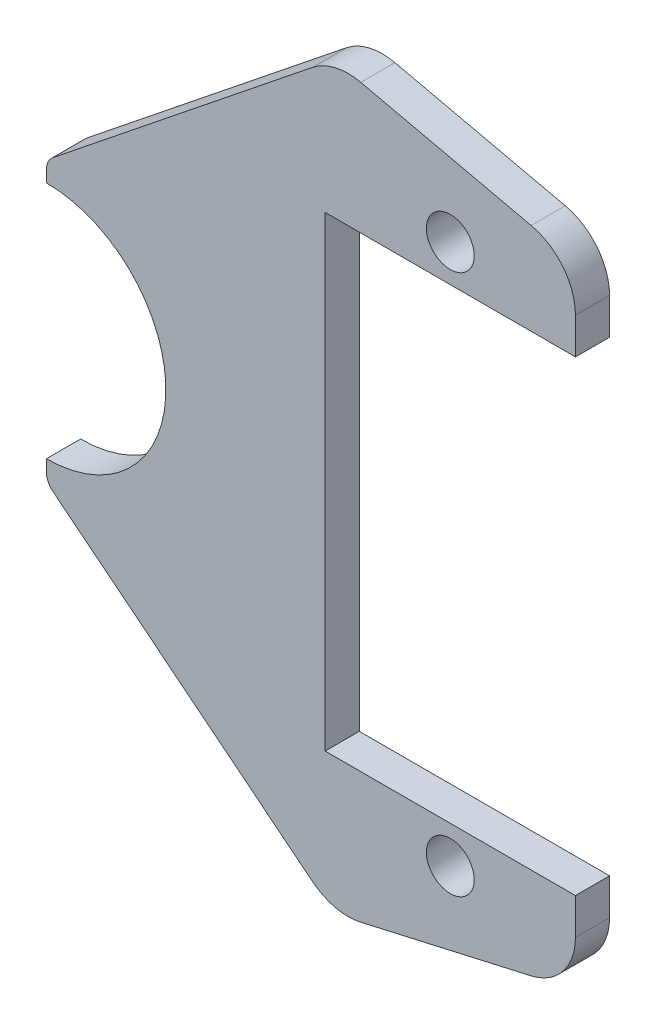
ISO-10303-21;
HEADER;
FILE_DESCRIPTION(('STEP AP214'),'2;1');
FILE_NAME('part.step','',(''),(''),'','','');
FILE_SCHEMA(('AUTOMOTIVE_DESIGN { 1 0 10303 214 1 1 1 1 }'));
ENDSEC;
DATA;
#1=APPLICATION_CONTEXT('core data for automotive mechanical design processes');
#2=APPLICATION_PROTOCOL_DEFINITION('international standard','automotive_design',2000,#1);
#3=PRODUCT_CONTEXT('',#1,'mechanical');
#4=PRODUCT('Part','Part','',(#3));
#5=PRODUCT_RELATED_PRODUCT_CATEGORY('part','',(#4));
#6=PRODUCT_DEFINITION_FORMATION('','',#4);
#7=PRODUCT_DEFINITION_CONTEXT('part definition',#1,'design');
#8=PRODUCT_DEFINITION('design','',#6,#7);
#9=PRODUCT_DEFINITION_SHAPE('','',#8);
#10=(LENGTH_UNIT() NAMED_UNIT(*) SI_UNIT(.MILLI.,.METRE.));
#11=(NAMED_UNIT(*) PLANE_ANGLE_UNIT() SI_UNIT($,.RADIAN.));
#12=(NAMED_UNIT(*) SI_UNIT($,.STERADIAN.) SOLID_ANGLE_UNIT());
#13=UNCERTAINTY_MEASURE_WITH_UNIT(LENGTH_MEASURE(1.E-05),#10,'distance_accuracy_value','');
#14=(GEOMETRIC_REPRESENTATION_CONTEXT(3) GLOBAL_UNCERTAINTY_ASSIGNED_CONTEXT((#13)) GLOBAL_UNIT_ASSIGNED_CONTEXT((#10,
#11,#12)) REPRESENTATION_CONTEXT('',''));
#15=CARTESIAN_POINT('',(0.,0.,0.));
#16=DIRECTION('',(0.,0.,1.));
#17=DIRECTION('',(1.,0.,0.));
#18=AXIS2_PLACEMENT_3D('',#15,#16,#17);
#19=CARTESIAN_POINT('',(83.,47.3732157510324,6.));
#20=DIRECTION('',(0.,0.,-1.));
#21=DIRECTION('',(-1.,0.,0.));
#22=AXIS2_PLACEMENT_3D('',#19,#20,#21);
#23=PLANE('',#22);
#24=CARTESIAN_POINT('',(71.,47.5,6.));
#25=DIRECTION('',(0.,0.,1.));
#26=DIRECTION('',(1.,0.,0.));
#27=AXIS2_PLACEMENT_3D('',#24,#25,#26);
#28=CIRCLE('',#27,4.2);
#29=CARTESIAN_POINT('',(75.2,47.5,6.));
#30=VERTEX_POINT('',#29);
#31=EDGE_CURVE('E174',#30,#30,#28,.T.);
#32=ORIENTED_EDGE('',*,*,#31,.F.);
#33=EDGE_LOOP('',(#32));
#34=FACE_BOUND('',#33,.T.);
#35=DIRECTION('',(1.,0.,0.));
#36=VECTOR('',#35,1.);
#37=CARTESIAN_POINT('',(49.,41.,6.));
#38=LINE('',#37,#36);
#39=CARTESIAN_POINT('',(49.,41.,6.));
#40=VERTEX_POINT('',#39);
#41=CARTESIAN_POINT('',(93.,41.,6.));
#42=VERTEX_POINT('',#41);
#43=EDGE_CURVE('E212',#40,#42,#38,.T.);
#44=ORIENTED_EDGE('',*,*,#43,.T.);
#45=DIRECTION('',(0.,1.,0.));
#46=VECTOR('',#45,1.);
#47=CARTESIAN_POINT('',(93.,41.,6.));
#48=LINE('',#47,#46);
#49=CARTESIAN_POINT('',(93.,47.3732157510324,6.));
#50=VERTEX_POINT('',#49);
#51=EDGE_CURVE('E169',#42,#50,#48,.T.);
#52=ORIENTED_EDGE('',*,*,#51,.T.);
#53=CARTESIAN_POINT('',(83.,47.3732157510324,6.));
#54=DIRECTION('',(0.,0.,1.));
#55=DIRECTION('',(-1.,0.,0.));
#56=AXIS2_PLACEMENT_3D('',#53,#54,#55);
#57=CIRCLE('',#56,10.);
#58=CARTESIAN_POINT('',(85.2154849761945,57.1247092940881,6.));
#59=VERTEX_POINT('',#58);
#60=EDGE_CURVE('E215',#50,#59,#57,.T.);
#61=ORIENTED_EDGE('',*,*,#60,.T.);
#62=DIRECTION('',(-0.975149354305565,0.221548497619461,0.));
#63=VECTOR('',#62,1.);
#64=CARTESIAN_POINT('',(85.2154849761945,57.1247092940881,6.));
#65=LINE('',#64,#63);
#66=CARTESIAN_POINT('',(55.2558255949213,63.9313769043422,6.));
#67=VERTEX_POINT('',#66);
#68=EDGE_CURVE('E217',#59,#67,#65,.T.);
#69=ORIENTED_EDGE('',*,*,#68,.T.);
#70=CARTESIAN_POINT('',(53.0403406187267,54.1798833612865,6.));
#71=DIRECTION('',(0.,0.,1.));
#72=DIRECTION('',(-1.,0.,0.));
#73=AXIS2_PLACEMENT_3D('',#70,#71,#72);
#74=CIRCLE('',#73,10.);
#75=CARTESIAN_POINT('',(46.7879140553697,61.9841874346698,6.));
#76=VERTEX_POINT('',#75);
#77=EDGE_CURVE('E219',#67,#76,#74,.T.);
#78=ORIENTED_EDGE('',*,*,#77,.T.);
#79=DIRECTION('',(-0.780430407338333,-0.625242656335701,0.));
#80=VECTOR('',#79,1.);
#81=CARTESIAN_POINT('',(46.7879140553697,61.9841874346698,6.));
#82=LINE('',#81,#80);
#83=CARTESIAN_POINT('',(1.12427203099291,25.4007117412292,6.));
#84=VERTEX_POINT('',#83);
#85=EDGE_CURVE('E221',#76,#84,#82,.T.);
#86=ORIENTED_EDGE('',*,*,#85,.T.);
#87=CARTESIAN_POINT('',(3.,23.0594205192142,6.));
#88=DIRECTION('',(0.,0.,1.));
#89=DIRECTION('',(1.,0.,0.));
#90=AXIS2_PLACEMENT_3D('',#87,#88,#89);
#91=CIRCLE('',#90,3.);
#92=CARTESIAN_POINT('',(0.,23.0594205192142,6.));
#93=VERTEX_POINT('',#92);
#94=EDGE_CURVE('E223',#84,#93,#91,.T.);
#95=ORIENTED_EDGE('',*,*,#94,.T.);
#96=DIRECTION('',(0.,-1.,0.));
#97=VECTOR('',#96,1.);
#98=CARTESIAN_POINT('',(0.,23.0594205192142,6.));
#99=LINE('',#98,#97);
#100=CARTESIAN_POINT('',(0.,21.,6.));
#101=VERTEX_POINT('',#100);
#102=EDGE_CURVE('E225',#93,#101,#99,.T.);
#103=ORIENTED_EDGE('',*,*,#102,.T.);
#104=CARTESIAN_POINT('',(0.,0.,6.));
#105=DIRECTION('',(0.,0.,-1.));
#106=DIRECTION('',(-1.,0.,0.));
#107=AXIS2_PLACEMENT_3D('',#104,#105,#106);
#108=CIRCLE('',#107,21.);
#109=CARTESIAN_POINT('',(0.,-21.,6.));
#110=VERTEX_POINT('',#109);
#111=EDGE_CURVE('E227',#101,#110,#108,.T.);
#112=ORIENTED_EDGE('',*,*,#111,.T.);
#113=DIRECTION('',(0.,-1.,0.));
#114=VECTOR('',#113,1.);
#115=CARTESIAN_POINT('',(0.,-23.0594205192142,6.));
#116=LINE('',#115,#114);
#117=CARTESIAN_POINT('',(0.,-23.0594205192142,6.));
#118=VERTEX_POINT('',#117);
#119=EDGE_CURVE('E229',#110,#118,#116,.T.);
#120=ORIENTED_EDGE('',*,*,#119,.T.);
#121=CARTESIAN_POINT('',(3.,-23.0594205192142,6.));
#122=DIRECTION('',(0.,0.,1.));
#123=DIRECTION('',(-1.,0.,0.));
#124=AXIS2_PLACEMENT_3D('',#121,#122,#123);
#125=CIRCLE('',#124,3.);
#126=CARTESIAN_POINT('',(1.12427203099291,-25.4007117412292,6.));
#127=VERTEX_POINT('',#126);
#128=EDGE_CURVE('E231',#118,#127,#125,.T.);
#129=ORIENTED_EDGE('',*,*,#128,.T.);
#130=DIRECTION('',(0.780430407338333,-0.625242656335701,0.));
#131=VECTOR('',#130,1.);
#132=CARTESIAN_POINT('',(46.7879140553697,-61.9841874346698,6.));
#133=LINE('',#132,#131);
#134=CARTESIAN_POINT('',(46.7879140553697,-61.9841874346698,6.));
#135=VERTEX_POINT('',#134);
#136=EDGE_CURVE('E233',#127,#135,#133,.T.);
#137=ORIENTED_EDGE('',*,*,#136,.T.);
#138=CARTESIAN_POINT('',(53.0403406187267,-54.1798833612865,6.));
#139=DIRECTION('',(0.,0.,1.));
#140=DIRECTION('',(1.,0.,0.));
#141=AXIS2_PLACEMENT_3D('',#138,#139,#140);
#142=CIRCLE('',#141,10.);
#143=CARTESIAN_POINT('',(55.2558255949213,-63.9313769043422,6.));
#144=VERTEX_POINT('',#143);
#145=EDGE_CURVE('E235',#135,#144,#142,.T.);
#146=ORIENTED_EDGE('',*,*,#145,.T.);
#147=DIRECTION('',(0.975149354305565,0.221548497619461,0.));
#148=VECTOR('',#147,1.);
#149=CARTESIAN_POINT('',(85.2154849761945,-57.1247092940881,6.));
#150=LINE('',#149,#148);
#151=CARTESIAN_POINT('',(85.2154849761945,-57.1247092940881,6.));
#152=VERTEX_POINT('',#151);
#153=EDGE_CURVE('E237',#144,#152,#150,.T.);
#154=ORIENTED_EDGE('',*,*,#153,.T.);
#155=CARTESIAN_POINT('',(83.,-47.3732157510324,6.));
#156=DIRECTION('',(0.,0.,1.));
#157=DIRECTION('',(1.,0.,0.));
#158=AXIS2_PLACEMENT_3D('',#155,#156,#157);
#159=CIRCLE('',#158,10.);
#160=CARTESIAN_POINT('',(93.,-47.3732157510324,6.));
#161=VERTEX_POINT('',#160);
#162=EDGE_CURVE('E239',#152,#161,#159,.T.);
#163=ORIENTED_EDGE('',*,*,#162,.T.);
#164=DIRECTION('',(0.,1.,0.));
#165=VECTOR('',#164,1.);
#166=CARTESIAN_POINT('',(93.,-41.,6.));
#167=LINE('',#166,#165);
#168=CARTESIAN_POINT('',(93.,-41.,6.));
#169=VERTEX_POINT('',#168);
#170=EDGE_CURVE('E241',#161,#169,#167,.T.);
#171=ORIENTED_EDGE('',*,*,#170,.T.);
#172=DIRECTION('',(-1.,0.,0.));
#173=VECTOR('',#172,1.);
#174=CARTESIAN_POINT('',(49.,-41.,6.));
#175=LINE('',#174,#173);
#176=CARTESIAN_POINT('',(49.,-41.,6.));
#177=VERTEX_POINT('',#176);
#178=EDGE_CURVE('E50',#169,#177,#175,.T.);
#179=ORIENTED_EDGE('',*,*,#178,.T.);
#180=DIRECTION('',(0.,1.,0.));
#181=VECTOR('',#180,1.);
#182=CARTESIAN_POINT('',(49.,-41.,6.));
#183=LINE('',#182,#181);
#184=EDGE_CURVE('E45',#177,#40,#183,.T.);
#185=ORIENTED_EDGE('',*,*,#184,.T.);
#186=EDGE_LOOP('',(#44,#52,#61,#69,#78,#86,#95,#103,#112,#120,#129,#137,#146,#154,#163,#171,
#179,#185));
#187=FACE_BOUND('',#186,.T.);
#188=CARTESIAN_POINT('',(71.,-47.5,6.));
#189=DIRECTION('',(0.,0.,1.));
#190=DIRECTION('',(-1.,0.,0.));
#191=AXIS2_PLACEMENT_3D('',#188,#189,#190);
#192=CIRCLE('',#191,4.2);
#193=CARTESIAN_POINT('',(66.8,-47.5,6.));
#194=VERTEX_POINT('',#193);
#195=EDGE_CURVE('E392',#194,#194,#192,.T.);
#196=ORIENTED_EDGE('',*,*,#195,.F.);
#197=EDGE_LOOP('',(#196));
#198=FACE_BOUND('',#197,.T.);
#199=ADVANCED_FACE('F30',(#34,#187,#198),#23,.F.);
#200=CARTESIAN_POINT('',(83.,47.3732157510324,0.));
#201=DIRECTION('',(0.,0.,-1.));
#202=DIRECTION('',(-1.,0.,0.));
#203=AXIS2_PLACEMENT_3D('',#200,#201,#202);
#204=PLANE('',#203);
#205=CARTESIAN_POINT('',(71.,47.5,0.));
#206=DIRECTION('',(0.,0.,1.));
#207=DIRECTION('',(1.,0.,0.));
#208=AXIS2_PLACEMENT_3D('',#205,#206,#207);
#209=CIRCLE('',#208,4.2);
#210=CARTESIAN_POINT('',(75.2,47.5,0.));
#211=VERTEX_POINT('',#210);
#212=EDGE_CURVE('E177',#211,#211,#209,.T.);
#213=ORIENTED_EDGE('',*,*,#212,.T.);
#214=EDGE_LOOP('',(#213));
#215=FACE_BOUND('',#214,.T.);
#216=DIRECTION('',(1.,0.,0.));
#217=VECTOR('',#216,1.);
#218=CARTESIAN_POINT('',(49.,41.,0.));
#219=LINE('',#218,#217);
#220=CARTESIAN_POINT('',(49.,41.,0.));
#221=VERTEX_POINT('',#220);
#222=CARTESIAN_POINT('',(93.,41.,0.));
#223=VERTEX_POINT('',#222);
#224=EDGE_CURVE('E160',#221,#223,#219,.T.);
#225=ORIENTED_EDGE('',*,*,#224,.F.);
#226=DIRECTION('',(0.,1.,0.));
#227=VECTOR('',#226,1.);
#228=CARTESIAN_POINT('',(49.,-41.,0.));
#229=LINE('',#228,#227);
#230=CARTESIAN_POINT('',(49.,-41.,0.));
#231=VERTEX_POINT('',#230);
#232=EDGE_CURVE('E210',#231,#221,#229,.T.);
#233=ORIENTED_EDGE('',*,*,#232,.F.);
#234=DIRECTION('',(-1.,0.,0.));
#235=VECTOR('',#234,1.);
#236=CARTESIAN_POINT('',(49.,-41.,0.));
#237=LINE('',#236,#235);
#238=CARTESIAN_POINT('',(93.,-41.,0.));
#239=VERTEX_POINT('',#238);
#240=EDGE_CURVE('E208',#239,#231,#237,.T.);
#241=ORIENTED_EDGE('',*,*,#240,.F.);
#242=DIRECTION('',(0.,1.,0.));
#243=VECTOR('',#242,1.);
#244=CARTESIAN_POINT('',(93.,-41.,0.));
#245=LINE('',#244,#243);
#246=CARTESIAN_POINT('',(93.,-47.3732157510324,0.));
#247=VERTEX_POINT('',#246);
#248=EDGE_CURVE('E206',#247,#239,#245,.T.);
#249=ORIENTED_EDGE('',*,*,#248,.F.);
#250=CARTESIAN_POINT('',(83.,-47.3732157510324,0.));
#251=DIRECTION('',(0.,0.,1.));
#252=DIRECTION('',(1.,0.,0.));
#253=AXIS2_PLACEMENT_3D('',#250,#251,#252);
#254=CIRCLE('',#253,10.);
#255=CARTESIAN_POINT('',(85.2154849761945,-57.1247092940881,0.));
#256=VERTEX_POINT('',#255);
#257=EDGE_CURVE('E204',#256,#247,#254,.T.);
#258=ORIENTED_EDGE('',*,*,#257,.F.);
#259=DIRECTION('',(0.975149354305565,0.221548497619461,0.));
#260=VECTOR('',#259,1.);
#261=CARTESIAN_POINT('',(85.2154849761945,-57.1247092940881,0.));
#262=LINE('',#261,#260);
#263=CARTESIAN_POINT('',(55.2558255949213,-63.9313769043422,0.));
#264=VERTEX_POINT('',#263);
#265=EDGE_CURVE('E202',#264,#256,#262,.T.);
#266=ORIENTED_EDGE('',*,*,#265,.F.);
#267=CARTESIAN_POINT('',(53.0403406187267,-54.1798833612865,0.));
#268=DIRECTION('',(0.,0.,1.));
#269=DIRECTION('',(1.,0.,0.));
#270=AXIS2_PLACEMENT_3D('',#267,#268,#269);
#271=CIRCLE('',#270,10.);
#272=CARTESIAN_POINT('',(46.7879140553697,-61.9841874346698,0.));
#273=VERTEX_POINT('',#272);
#274=EDGE_CURVE('E200',#273,#264,#271,.T.);
#275=ORIENTED_EDGE('',*,*,#274,.F.);
#276=DIRECTION('',(0.780430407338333,-0.625242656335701,0.));
#277=VECTOR('',#276,1.);
#278=CARTESIAN_POINT('',(46.7879140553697,-61.9841874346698,0.));
#279=LINE('',#278,#277);
#280=CARTESIAN_POINT('',(1.12427203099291,-25.4007117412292,0.));
#281=VERTEX_POINT('',#280);
#282=EDGE_CURVE('E198',#281,#273,#279,.T.);
#283=ORIENTED_EDGE('',*,*,#282,.F.);
#284=CARTESIAN_POINT('',(3.,-23.0594205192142,0.));
#285=DIRECTION('',(0.,0.,1.));
#286=DIRECTION('',(-1.,0.,0.));
#287=AXIS2_PLACEMENT_3D('',#284,#285,#286);
#288=CIRCLE('',#287,3.);
#289=CARTESIAN_POINT('',(0.,-23.0594205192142,0.));
#290=VERTEX_POINT('',#289);
#291=EDGE_CURVE('E196',#290,#281,#288,.T.);
#292=ORIENTED_EDGE('',*,*,#291,.F.);
#293=DIRECTION('',(0.,-1.,0.));
#294=VECTOR('',#293,1.);
#295=CARTESIAN_POINT('',(0.,-23.0594205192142,0.));
#296=LINE('',#295,#294);
#297=CARTESIAN_POINT('',(0.,-21.,0.));
#298=VERTEX_POINT('',#297);
#299=EDGE_CURVE('E194',#298,#290,#296,.T.);
#300=ORIENTED_EDGE('',*,*,#299,.F.);
#301=CARTESIAN_POINT('',(0.,0.,0.));
#302=DIRECTION('',(0.,0.,-1.));
#303=DIRECTION('',(-1.,0.,0.));
#304=AXIS2_PLACEMENT_3D('',#301,#302,#303);
#305=CIRCLE('',#304,21.);
#306=CARTESIAN_POINT('',(0.,21.,0.));
#307=VERTEX_POINT('',#306);
#308=EDGE_CURVE('E192',#307,#298,#305,.T.);
#309=ORIENTED_EDGE('',*,*,#308,.F.);
#310=DIRECTION('',(0.,-1.,0.));
#311=VECTOR('',#310,1.);
#312=CARTESIAN_POINT('',(0.,23.0594205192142,0.));
#313=LINE('',#312,#311);
#314=CARTESIAN_POINT('',(0.,23.0594205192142,0.));
#315=VERTEX_POINT('',#314);
#316=EDGE_CURVE('E190',#315,#307,#313,.T.);
#317=ORIENTED_EDGE('',*,*,#316,.F.);
#318=CARTESIAN_POINT('',(3.,23.0594205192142,0.));
#319=DIRECTION('',(0.,0.,1.));
#320=DIRECTION('',(1.,0.,0.));
#321=AXIS2_PLACEMENT_3D('',#318,#319,#320);
#322=CIRCLE('',#321,3.);
#323=CARTESIAN_POINT('',(1.12427203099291,25.4007117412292,0.));
#324=VERTEX_POINT('',#323);
#325=EDGE_CURVE('E188',#324,#315,#322,.T.);
#326=ORIENTED_EDGE('',*,*,#325,.F.);
#327=DIRECTION('',(-0.780430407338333,-0.625242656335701,0.));
#328=VECTOR('',#327,1.);
#329=CARTESIAN_POINT('',(46.7879140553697,61.9841874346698,0.));
#330=LINE('',#329,#328);
#331=CARTESIAN_POINT('',(46.7879140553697,61.9841874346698,0.));
#332=VERTEX_POINT('',#331);
#333=EDGE_CURVE('E186',#332,#324,#330,.T.);
#334=ORIENTED_EDGE('',*,*,#333,.F.);
#335=CARTESIAN_POINT('',(53.0403406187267,54.1798833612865,0.));
#336=DIRECTION('',(0.,0.,1.));
#337=DIRECTION('',(-1.,0.,0.));
#338=AXIS2_PLACEMENT_3D('',#335,#336,#337);
#339=CIRCLE('',#338,10.);
#340=CARTESIAN_POINT('',(55.2558255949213,63.9313769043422,0.));
#341=VERTEX_POINT('',#340);
#342=EDGE_CURVE('E184',#341,#332,#339,.T.);
#343=ORIENTED_EDGE('',*,*,#342,.F.);
#344=DIRECTION('',(-0.975149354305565,0.221548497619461,0.));
#345=VECTOR('',#344,1.);
#346=CARTESIAN_POINT('',(85.2154849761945,57.1247092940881,0.));
#347=LINE('',#346,#345);
#348=CARTESIAN_POINT('',(85.2154849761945,57.1247092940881,0.));
#349=VERTEX_POINT('',#348);
#350=EDGE_CURVE('E182',#349,#341,#347,.T.);
#351=ORIENTED_EDGE('',*,*,#350,.F.);
#352=CARTESIAN_POINT('',(83.,47.3732157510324,0.));
#353=DIRECTION('',(0.,0.,1.));
#354=DIRECTION('',(-1.,0.,0.));
#355=AXIS2_PLACEMENT_3D('',#352,#353,#354);
#356=CIRCLE('',#355,10.);
#357=CARTESIAN_POINT('',(93.,47.3732157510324,0.));
#358=VERTEX_POINT('',#357);
#359=EDGE_CURVE('E162',#358,#349,#356,.T.);
#360=ORIENTED_EDGE('',*,*,#359,.F.);
#361=DIRECTION('',(0.,1.,0.));
#362=VECTOR('',#361,1.);
#363=CARTESIAN_POINT('',(93.,41.,0.));
#364=LINE('',#363,#362);
#365=EDGE_CURVE('E155',#223,#358,#364,.T.);
#366=ORIENTED_EDGE('',*,*,#365,.F.);
#367=EDGE_LOOP('',(#225,#233,#241,#249,#258,#266,#275,#283,#292,#300,#309,#317,#326,#334,#343,
#351,#360,#366));
#368=FACE_BOUND('',#367,.T.);
#369=CARTESIAN_POINT('',(71.,-47.5,0.));
#370=DIRECTION('',(0.,0.,1.));
#371=DIRECTION('',(-1.,0.,0.));
#372=AXIS2_PLACEMENT_3D('',#369,#370,#371);
#373=CIRCLE('',#372,4.2);
#374=CARTESIAN_POINT('',(66.8,-47.5,0.));
#375=VERTEX_POINT('',#374);
#376=EDGE_CURVE('E395',#375,#375,#373,.T.);
#377=ORIENTED_EDGE('',*,*,#376,.T.);
#378=EDGE_LOOP('',(#377));
#379=FACE_BOUND('',#378,.T.);
#380=ADVANCED_FACE('F156',(#215,#368,#379),#204,.T.);
#381=CARTESIAN_POINT('',(49.,41.,6.));
#382=DIRECTION('',(0.,1.,0.));
#383=DIRECTION('',(-1.,0.,0.));
#384=AXIS2_PLACEMENT_3D('',#381,#382,#383);
#385=PLANE('',#384);
#386=ORIENTED_EDGE('',*,*,#224,.T.);
#387=DIRECTION('',(0.,0.,-1.));
#388=VECTOR('',#387,1.);
#389=CARTESIAN_POINT('',(93.,41.,6.));
#390=LINE('',#389,#388);
#391=EDGE_CURVE('E11',#42,#223,#390,.T.);
#392=ORIENTED_EDGE('',*,*,#391,.F.);
#393=ORIENTED_EDGE('',*,*,#43,.F.);
#394=DIRECTION('',(0.,0.,-1.));
#395=VECTOR('',#394,1.);
#396=CARTESIAN_POINT('',(49.,41.,6.));
#397=LINE('',#396,#395);
#398=EDGE_CURVE('E173',#40,#221,#397,.T.);
#399=ORIENTED_EDGE('',*,*,#398,.T.);
#400=EDGE_LOOP('',(#386,#392,#393,#399));
#401=FACE_BOUND('',#400,.T.);
#402=ADVANCED_FACE('F32',(#401),#385,.F.);
#403=CARTESIAN_POINT('',(93.,41.,6.));
#404=DIRECTION('',(-1.,0.,0.));
#405=DIRECTION('',(0.,0.,1.));
#406=AXIS2_PLACEMENT_3D('',#403,#404,#405);
#407=PLANE('',#406);
#408=ORIENTED_EDGE('',*,*,#365,.T.);
#409=DIRECTION('',(0.,0.,-1.));
#410=VECTOR('',#409,1.);
#411=CARTESIAN_POINT('',(93.,47.3732157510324,6.));
#412=LINE('',#411,#410);
#413=EDGE_CURVE('E38',#50,#358,#412,.T.);
#414=ORIENTED_EDGE('',*,*,#413,.F.);
#415=ORIENTED_EDGE('',*,*,#51,.F.);
#416=ORIENTED_EDGE('',*,*,#391,.T.);
#417=EDGE_LOOP('',(#408,#414,#415,#416));
#418=FACE_BOUND('',#417,.T.);
#419=ADVANCED_FACE('F168',(#418),#407,.F.);
#420=CARTESIAN_POINT('',(83.,47.3732157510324,6.));
#421=DIRECTION('',(0.,0.,-1.));
#422=DIRECTION('',(-1.,0.,0.));
#423=AXIS2_PLACEMENT_3D('',#420,#421,#422);
#424=CYLINDRICAL_SURFACE('',#423,10.);
#425=ORIENTED_EDGE('',*,*,#359,.T.);
#426=DIRECTION('',(0.,0.,-1.));
#427=VECTOR('',#426,1.);
#428=CARTESIAN_POINT('',(85.2154849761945,57.1247092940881,6.));
#429=LINE('',#428,#427);
#430=EDGE_CURVE('E288',#59,#349,#429,.T.);
#431=ORIENTED_EDGE('',*,*,#430,.F.);
#432=ORIENTED_EDGE('',*,*,#60,.F.);
#433=ORIENTED_EDGE('',*,*,#413,.T.);
#434=EDGE_LOOP('',(#425,#431,#432,#433));
#435=FACE_BOUND('',#434,.T.);
#436=ADVANCED_FACE('F292',(#435),#424,.T.);
#437=CARTESIAN_POINT('',(85.2154849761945,57.1247092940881,6.));
#438=DIRECTION('',(-0.221548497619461,-0.975149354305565,0.));
#439=DIRECTION('',(0.975149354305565,-0.221548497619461,0.));
#440=AXIS2_PLACEMENT_3D('',#437,#438,#439);
#441=PLANE('',#440);
#442=ORIENTED_EDGE('',*,*,#350,.T.);
#443=DIRECTION('',(0.,0.,-1.));
#444=VECTOR('',#443,1.);
#445=CARTESIAN_POINT('',(55.2558255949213,63.9313769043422,6.));
#446=LINE('',#445,#444);
#447=EDGE_CURVE('E285',#67,#341,#446,.T.);
#448=ORIENTED_EDGE('',*,*,#447,.F.);
#449=ORIENTED_EDGE('',*,*,#68,.F.);
#450=ORIENTED_EDGE('',*,*,#430,.T.);
#451=EDGE_LOOP('',(#442,#448,#449,#450));
#452=FACE_BOUND('',#451,.T.);
#453=ADVANCED_FACE('F300',(#452),#441,.F.);
#454=CARTESIAN_POINT('',(53.0403406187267,54.1798833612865,6.));
#455=DIRECTION('',(0.,0.,-1.));
#456=DIRECTION('',(-1.,0.,0.));
#457=AXIS2_PLACEMENT_3D('',#454,#455,#456);
#458=CYLINDRICAL_SURFACE('',#457,10.);
#459=ORIENTED_EDGE('',*,*,#342,.T.);
#460=DIRECTION('',(0.,0.,-1.));
#461=VECTOR('',#460,1.);
#462=CARTESIAN_POINT('',(46.7879140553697,61.9841874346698,6.));
#463=LINE('',#462,#461);
#464=EDGE_CURVE('E282',#76,#332,#463,.T.);
#465=ORIENTED_EDGE('',*,*,#464,.F.);
#466=ORIENTED_EDGE('',*,*,#77,.F.);
#467=ORIENTED_EDGE('',*,*,#447,.T.);
#468=EDGE_LOOP('',(#459,#465,#466,#467));
#469=FACE_BOUND('',#468,.T.);
#470=ADVANCED_FACE('F303',(#469),#458,.T.);
#471=CARTESIAN_POINT('',(46.7879140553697,61.9841874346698,6.));
#472=DIRECTION('',(0.625242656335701,-0.780430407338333,0.));
#473=DIRECTION('',(0.780430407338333,0.625242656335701,0.));
#474=AXIS2_PLACEMENT_3D('',#471,#472,#473);
#475=PLANE('',#474);
#476=ORIENTED_EDGE('',*,*,#333,.T.);
#477=DIRECTION('',(0.,0.,-1.));
#478=VECTOR('',#477,1.);
#479=CARTESIAN_POINT('',(1.12427203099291,25.4007117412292,6.));
#480=LINE('',#479,#478);
#481=EDGE_CURVE('E279',#84,#324,#480,.T.);
#482=ORIENTED_EDGE('',*,*,#481,.F.);
#483=ORIENTED_EDGE('',*,*,#85,.F.);
#484=ORIENTED_EDGE('',*,*,#464,.T.);
#485=EDGE_LOOP('',(#476,#482,#483,#484));
#486=FACE_BOUND('',#485,.T.);
#487=ADVANCED_FACE('F308',(#486),#475,.F.);
#488=CARTESIAN_POINT('',(3.,23.0594205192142,6.));
#489=DIRECTION('',(0.,0.,-1.));
#490=DIRECTION('',(-1.,0.,0.));
#491=AXIS2_PLACEMENT_3D('',#488,#489,#490);
#492=CYLINDRICAL_SURFACE('',#491,3.);
#493=ORIENTED_EDGE('',*,*,#325,.T.);
#494=DIRECTION('',(0.,0.,-1.));
#495=VECTOR('',#494,1.);
#496=CARTESIAN_POINT('',(0.,23.0594205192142,6.));
#497=LINE('',#496,#495);
#498=EDGE_CURVE('E276',#93,#315,#497,.T.);
#499=ORIENTED_EDGE('',*,*,#498,.F.);
#500=ORIENTED_EDGE('',*,*,#94,.F.);
#501=ORIENTED_EDGE('',*,*,#481,.T.);
#502=EDGE_LOOP('',(#493,#499,#500,#501));
#503=FACE_BOUND('',#502,.T.);
#504=ADVANCED_FACE('F314',(#503),#492,.T.);
#505=CARTESIAN_POINT('',(0.,23.0594205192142,6.));
#506=DIRECTION('',(1.,0.,0.));
#507=DIRECTION('',(0.,1.,0.));
#508=AXIS2_PLACEMENT_3D('',#505,#506,#507);
#509=PLANE('',#508);
#510=ORIENTED_EDGE('',*,*,#316,.T.);
#511=DIRECTION('',(0.,0.,-1.));
#512=VECTOR('',#511,1.);
#513=CARTESIAN_POINT('',(0.,21.,6.));
#514=LINE('',#513,#512);
#515=EDGE_CURVE('E273',#101,#307,#514,.T.);
#516=ORIENTED_EDGE('',*,*,#515,.F.);
#517=ORIENTED_EDGE('',*,*,#102,.F.);
#518=ORIENTED_EDGE('',*,*,#498,.T.);
#519=EDGE_LOOP('',(#510,#516,#517,#518));
#520=FACE_BOUND('',#519,.T.);
#521=ADVANCED_FACE('F318',(#520),#509,.F.);
#522=CARTESIAN_POINT('',(0.,0.,6.));
#523=DIRECTION('',(0.,0.,-1.));
#524=DIRECTION('',(-1.,0.,0.));
#525=AXIS2_PLACEMENT_3D('',#522,#523,#524);
#526=CYLINDRICAL_SURFACE('',#525,21.);
#527=ORIENTED_EDGE('',*,*,#308,.T.);
#528=DIRECTION('',(0.,0.,-1.));
#529=VECTOR('',#528,1.);
#530=CARTESIAN_POINT('',(0.,-21.,6.));
#531=LINE('',#530,#529);
#532=EDGE_CURVE('E270',#110,#298,#531,.T.);
#533=ORIENTED_EDGE('',*,*,#532,.F.);
#534=ORIENTED_EDGE('',*,*,#111,.F.);
#535=ORIENTED_EDGE('',*,*,#515,.T.);
#536=EDGE_LOOP('',(#527,#533,#534,#535));
#537=FACE_BOUND('',#536,.T.);
#538=ADVANCED_FACE('F323',(#537),#526,.F.);
#539=CARTESIAN_POINT('',(0.,-23.0594205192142,6.));
#540=DIRECTION('',(1.,0.,0.));
#541=DIRECTION('',(0.,1.,0.));
#542=AXIS2_PLACEMENT_3D('',#539,#540,#541);
#543=PLANE('',#542);
#544=ORIENTED_EDGE('',*,*,#299,.T.);
#545=DIRECTION('',(0.,0.,-1.));
#546=VECTOR('',#545,1.);
#547=CARTESIAN_POINT('',(0.,-23.0594205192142,6.));
#548=LINE('',#547,#546);
#549=EDGE_CURVE('E267',#118,#290,#548,.T.);
#550=ORIENTED_EDGE('',*,*,#549,.F.);
#551=ORIENTED_EDGE('',*,*,#119,.F.);
#552=ORIENTED_EDGE('',*,*,#532,.T.);
#553=EDGE_LOOP('',(#544,#550,#551,#552));
#554=FACE_BOUND('',#553,.T.);
#555=ADVANCED_FACE('F329',(#554),#543,.F.);
#556=CARTESIAN_POINT('',(3.,-23.0594205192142,6.));
#557=DIRECTION('',(0.,0.,-1.));
#558=DIRECTION('',(-1.,0.,0.));
#559=AXIS2_PLACEMENT_3D('',#556,#557,#558);
#560=CYLINDRICAL_SURFACE('',#559,3.);
#561=ORIENTED_EDGE('',*,*,#291,.T.);
#562=DIRECTION('',(0.,0.,-1.));
#563=VECTOR('',#562,1.);
#564=CARTESIAN_POINT('',(1.12427203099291,-25.4007117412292,6.));
#565=LINE('',#564,#563);
#566=EDGE_CURVE('E264',#127,#281,#565,.T.);
#567=ORIENTED_EDGE('',*,*,#566,.F.);
#568=ORIENTED_EDGE('',*,*,#128,.F.);
#569=ORIENTED_EDGE('',*,*,#549,.T.);
#570=EDGE_LOOP('',(#561,#567,#568,#569));
#571=FACE_BOUND('',#570,.T.);
#572=ADVANCED_FACE('F333',(#571),#560,.T.);
#573=CARTESIAN_POINT('',(46.7879140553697,-61.9841874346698,6.));
#574=DIRECTION('',(0.625242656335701,0.780430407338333,0.));
#575=DIRECTION('',(-0.780430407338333,0.625242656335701,0.));
#576=AXIS2_PLACEMENT_3D('',#573,#574,#575);
#577=PLANE('',#576);
#578=ORIENTED_EDGE('',*,*,#282,.T.);
#579=DIRECTION('',(0.,0.,-1.));
#580=VECTOR('',#579,1.);
#581=CARTESIAN_POINT('',(46.7879140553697,-61.9841874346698,6.));
#582=LINE('',#581,#580);
#583=EDGE_CURVE('E261',#135,#273,#582,.T.);
#584=ORIENTED_EDGE('',*,*,#583,.F.);
#585=ORIENTED_EDGE('',*,*,#136,.F.);
#586=ORIENTED_EDGE('',*,*,#566,.T.);
#587=EDGE_LOOP('',(#578,#584,#585,#586));
#588=FACE_BOUND('',#587,.T.);
#589=ADVANCED_FACE('F338',(#588),#577,.F.);
#590=CARTESIAN_POINT('',(53.0403406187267,-54.1798833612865,6.));
#591=DIRECTION('',(0.,0.,-1.));
#592=DIRECTION('',(-1.,0.,0.));
#593=AXIS2_PLACEMENT_3D('',#590,#591,#592);
#594=CYLINDRICAL_SURFACE('',#593,10.);
#595=ORIENTED_EDGE('',*,*,#274,.T.);
#596=DIRECTION('',(0.,0.,-1.));
#597=VECTOR('',#596,1.);
#598=CARTESIAN_POINT('',(55.2558255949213,-63.9313769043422,6.));
#599=LINE('',#598,#597);
#600=EDGE_CURVE('E258',#144,#264,#599,.T.);
#601=ORIENTED_EDGE('',*,*,#600,.F.);
#602=ORIENTED_EDGE('',*,*,#145,.F.);
#603=ORIENTED_EDGE('',*,*,#583,.T.);
#604=EDGE_LOOP('',(#595,#601,#602,#603));
#605=FACE_BOUND('',#604,.T.);
#606=ADVANCED_FACE('F344',(#605),#594,.T.);
#607=CARTESIAN_POINT('',(85.2154849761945,-57.1247092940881,6.));
#608=DIRECTION('',(-0.221548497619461,0.975149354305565,0.));
#609=DIRECTION('',(-0.975149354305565,-0.221548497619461,0.));
#610=AXIS2_PLACEMENT_3D('',#607,#608,#609);
#611=PLANE('',#610);
#612=ORIENTED_EDGE('',*,*,#265,.T.);
#613=DIRECTION('',(0.,0.,-1.));
#614=VECTOR('',#613,1.);
#615=CARTESIAN_POINT('',(85.2154849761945,-57.1247092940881,6.));
#616=LINE('',#615,#614);
#617=EDGE_CURVE('E255',#152,#256,#616,.T.);
#618=ORIENTED_EDGE('',*,*,#617,.F.);
#619=ORIENTED_EDGE('',*,*,#153,.F.);
#620=ORIENTED_EDGE('',*,*,#600,.T.);
#621=EDGE_LOOP('',(#612,#618,#619,#620));
#622=FACE_BOUND('',#621,.T.);
#623=ADVANCED_FACE('F348',(#622),#611,.F.);
#624=CARTESIAN_POINT('',(83.,-47.3732157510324,6.));
#625=DIRECTION('',(0.,0.,-1.));
#626=DIRECTION('',(-1.,0.,0.));
#627=AXIS2_PLACEMENT_3D('',#624,#625,#626);
#628=CYLINDRICAL_SURFACE('',#627,10.);
#629=ORIENTED_EDGE('',*,*,#257,.T.);
#630=DIRECTION('',(0.,0.,-1.));
#631=VECTOR('',#630,1.);
#632=CARTESIAN_POINT('',(93.,-47.3732157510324,6.));
#633=LINE('',#632,#631);
#634=EDGE_CURVE('E252',#161,#247,#633,.T.);
#635=ORIENTED_EDGE('',*,*,#634,.F.);
#636=ORIENTED_EDGE('',*,*,#162,.F.);
#637=ORIENTED_EDGE('',*,*,#617,.T.);
#638=EDGE_LOOP('',(#629,#635,#636,#637));
#639=FACE_BOUND('',#638,.T.);
#640=ADVANCED_FACE('F353',(#639),#628,.T.);
#641=CARTESIAN_POINT('',(93.,-41.,6.));
#642=DIRECTION('',(-1.,0.,0.));
#643=DIRECTION('',(0.,0.,1.));
#644=AXIS2_PLACEMENT_3D('',#641,#642,#643);
#645=PLANE('',#644);
#646=ORIENTED_EDGE('',*,*,#248,.T.);
#647=DIRECTION('',(0.,0.,-1.));
#648=VECTOR('',#647,1.);
#649=CARTESIAN_POINT('',(93.,-41.,6.));
#650=LINE('',#649,#648);
#651=EDGE_CURVE('E249',#169,#239,#650,.T.);
#652=ORIENTED_EDGE('',*,*,#651,.F.);
#653=ORIENTED_EDGE('',*,*,#170,.F.);
#654=ORIENTED_EDGE('',*,*,#634,.T.);
#655=EDGE_LOOP('',(#646,#652,#653,#654));
#656=FACE_BOUND('',#655,.T.);
#657=ADVANCED_FACE('F357',(#656),#645,.F.);
#658=CARTESIAN_POINT('',(49.,-41.,6.));
#659=DIRECTION('',(0.,-1.,0.));
#660=DIRECTION('',(1.,0.,0.));
#661=AXIS2_PLACEMENT_3D('',#658,#659,#660);
#662=PLANE('',#661);
#663=ORIENTED_EDGE('',*,*,#240,.T.);
#664=DIRECTION('',(0.,0.,-1.));
#665=VECTOR('',#664,1.);
#666=CARTESIAN_POINT('',(49.,-41.,6.));
#667=LINE('',#666,#665);
#668=EDGE_CURVE('E246',#177,#231,#667,.T.);
#669=ORIENTED_EDGE('',*,*,#668,.F.);
#670=ORIENTED_EDGE('',*,*,#178,.F.);
#671=ORIENTED_EDGE('',*,*,#651,.T.);
#672=EDGE_LOOP('',(#663,#669,#670,#671));
#673=FACE_BOUND('',#672,.T.);
#674=ADVANCED_FACE('F361',(#673),#662,.F.);
#675=CARTESIAN_POINT('',(49.,-41.,6.));
#676=DIRECTION('',(-1.,0.,0.));
#677=DIRECTION('',(0.,0.,1.));
#678=AXIS2_PLACEMENT_3D('',#675,#676,#677);
#679=PLANE('',#678);
#680=ORIENTED_EDGE('',*,*,#232,.T.);
#681=ORIENTED_EDGE('',*,*,#398,.F.);
#682=ORIENTED_EDGE('',*,*,#184,.F.);
#683=ORIENTED_EDGE('',*,*,#668,.T.);
#684=EDGE_LOOP('',(#680,#681,#682,#683));
#685=FACE_BOUND('',#684,.T.);
#686=ADVANCED_FACE('F363',(#685),#679,.F.);
#687=CARTESIAN_POINT('',(71.,47.5,6.));
#688=DIRECTION('',(0.,0.,-1.));
#689=DIRECTION('',(-1.,0.,0.));
#690=AXIS2_PLACEMENT_3D('',#687,#688,#689);
#691=CYLINDRICAL_SURFACE('',#690,4.2);
#692=ORIENTED_EDGE('',*,*,#31,.T.);
#693=EDGE_LOOP('',(#692));
#694=FACE_BOUND('',#693,.T.);
#695=ORIENTED_EDGE('',*,*,#212,.F.);
#696=EDGE_LOOP('',(#695));
#697=FACE_BOUND('',#696,.T.);
#698=ADVANCED_FACE('F365',(#694,#697),#691,.F.);
#699=CARTESIAN_POINT('',(71.,-47.5,6.));
#700=DIRECTION('',(0.,0.,-1.));
#701=DIRECTION('',(-1.,0.,0.));
#702=AXIS2_PLACEMENT_3D('',#699,#700,#701);
#703=CYLINDRICAL_SURFACE('',#702,4.2);
#704=ORIENTED_EDGE('',*,*,#195,.T.);
#705=EDGE_LOOP('',(#704));
#706=FACE_BOUND('',#705,.T.);
#707=ORIENTED_EDGE('',*,*,#376,.F.);
#708=EDGE_LOOP('',(#707));
#709=FACE_BOUND('',#708,.T.);
#710=ADVANCED_FACE('F371',(#706,#709),#703,.F.);
#711=CLOSED_SHELL('',(#199,#380,#402,#419,#436,#453,#470,#487,#504,#521,#538,#555,#572,#589,
#606,#623,#640,#657,#674,#686,#698,#710));
#712=MANIFOLD_SOLID_BREP('B2',#711);
#713=ADVANCED_BREP_SHAPE_REPRESENTATION('',(#18,#712),#14);
#714=SHAPE_DEFINITION_REPRESENTATION(#9,#713);
ENDSEC;
END-ISO-10303-21;
